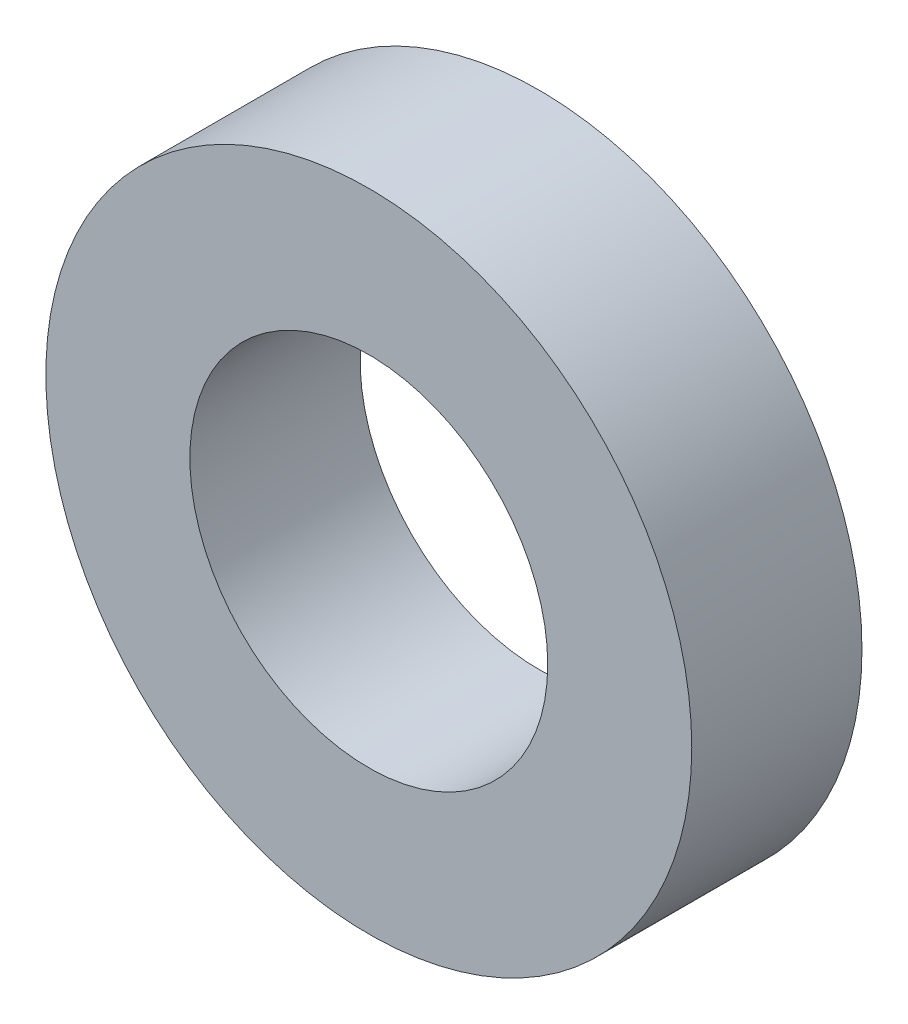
ISO-10303-21;
HEADER;
FILE_DESCRIPTION(('STEP AP214'),'2;1');
FILE_NAME('part.step','',(''),(''),'','','');
FILE_SCHEMA(('AUTOMOTIVE_DESIGN { 1 0 10303 214 1 1 1 1 }'));
ENDSEC;
DATA;
#1=APPLICATION_CONTEXT('core data for automotive mechanical design processes');
#2=APPLICATION_PROTOCOL_DEFINITION('international standard','automotive_design',2000,#1);
#3=PRODUCT_CONTEXT('',#1,'mechanical');
#4=PRODUCT('Part','Part','',(#3));
#5=PRODUCT_RELATED_PRODUCT_CATEGORY('part','',(#4));
#6=PRODUCT_DEFINITION_FORMATION('','',#4);
#7=PRODUCT_DEFINITION_CONTEXT('part definition',#1,'design');
#8=PRODUCT_DEFINITION('design','',#6,#7);
#9=PRODUCT_DEFINITION_SHAPE('','',#8);
#10=(LENGTH_UNIT() NAMED_UNIT(*) SI_UNIT(.MILLI.,.METRE.));
#11=(NAMED_UNIT(*) PLANE_ANGLE_UNIT() SI_UNIT($,.RADIAN.));
#12=(NAMED_UNIT(*) SI_UNIT($,.STERADIAN.) SOLID_ANGLE_UNIT());
#13=UNCERTAINTY_MEASURE_WITH_UNIT(LENGTH_MEASURE(1.E-05),#10,'distance_accuracy_value','');
#14=(GEOMETRIC_REPRESENTATION_CONTEXT(3) GLOBAL_UNCERTAINTY_ASSIGNED_CONTEXT((#13)) GLOBAL_UNIT_ASSIGNED_CONTEXT((#10,
#11,#12)) REPRESENTATION_CONTEXT('',''));
#15=CARTESIAN_POINT('',(0.,0.,0.));
#16=DIRECTION('',(0.,0.,1.));
#17=DIRECTION('',(1.,0.,0.));
#18=AXIS2_PLACEMENT_3D('',#15,#16,#17);
#19=CARTESIAN_POINT('',(0.,4.1,0.));
#20=DIRECTION('',(0.,0.,-1.));
#21=DIRECTION('',(-1.,0.,0.));
#22=AXIS2_PLACEMENT_3D('',#19,#20,#21);
#23=PLANE('',#22);
#24=CARTESIAN_POINT('',(0.,0.,0.));
#25=DIRECTION('',(0.,0.,1.));
#26=DIRECTION('',(1.,0.,0.));
#27=AXIS2_PLACEMENT_3D('',#24,#25,#26);
#28=CIRCLE('',#27,4.1);
#29=CARTESIAN_POINT('',(4.1,0.,0.));
#30=VERTEX_POINT('',#29);
#31=EDGE_CURVE('E43',#30,#30,#28,.T.);
#32=ORIENTED_EDGE('',*,*,#31,.F.);
#33=EDGE_LOOP('',(#32));
#34=FACE_BOUND('',#33,.T.);
#35=CARTESIAN_POINT('',(0.,0.,0.));
#36=DIRECTION('',(0.,0.,1.));
#37=DIRECTION('',(1.,0.,0.));
#38=AXIS2_PLACEMENT_3D('',#35,#36,#37);
#39=CIRCLE('',#38,7.4);
#40=CARTESIAN_POINT('',(7.4,0.,0.));
#41=VERTEX_POINT('',#40);
#42=EDGE_CURVE('E10',#41,#41,#39,.T.);
#43=ORIENTED_EDGE('',*,*,#42,.T.);
#44=EDGE_LOOP('',(#43));
#45=FACE_BOUND('',#44,.T.);
#46=ADVANCED_FACE('F29',(#34,#45),#23,.F.);
#47=CARTESIAN_POINT('',(0.,0.,0.));
#48=DIRECTION('',(0.,0.,1.));
#49=DIRECTION('',(1.,0.,0.));
#50=AXIS2_PLACEMENT_3D('',#47,#48,#49);
#51=CYLINDRICAL_SURFACE('',#50,7.4);
#52=ORIENTED_EDGE('',*,*,#42,.F.);
#53=EDGE_LOOP('',(#52));
#54=FACE_BOUND('',#53,.T.);
#55=CARTESIAN_POINT('',(0.,0.,-3.9));
#56=DIRECTION('',(0.,0.,1.));
#57=DIRECTION('',(1.,0.,0.));
#58=AXIS2_PLACEMENT_3D('',#55,#56,#57);
#59=CIRCLE('',#58,7.4);
#60=CARTESIAN_POINT('',(7.4,0.,-3.9));
#61=VERTEX_POINT('',#60);
#62=EDGE_CURVE('E35',#61,#61,#59,.T.);
#63=ORIENTED_EDGE('',*,*,#62,.T.);
#64=EDGE_LOOP('',(#63));
#65=FACE_BOUND('',#64,.T.);
#66=ADVANCED_FACE('F52',(#54,#65),#51,.T.);
#67=CARTESIAN_POINT('',(0.,4.1,-3.9));
#68=DIRECTION('',(0.,0.,1.));
#69=DIRECTION('',(1.,0.,0.));
#70=AXIS2_PLACEMENT_3D('',#67,#68,#69);
#71=PLANE('',#70);
#72=ORIENTED_EDGE('',*,*,#62,.F.);
#73=EDGE_LOOP('',(#72));
#74=FACE_BOUND('',#73,.T.);
#75=CARTESIAN_POINT('',(0.,0.,-3.9));
#76=DIRECTION('',(0.,0.,1.));
#77=DIRECTION('',(1.,0.,0.));
#78=AXIS2_PLACEMENT_3D('',#75,#76,#77);
#79=CIRCLE('',#78,4.1);
#80=CARTESIAN_POINT('',(4.1,0.,-3.9));
#81=VERTEX_POINT('',#80);
#82=EDGE_CURVE('E39',#81,#81,#79,.T.);
#83=ORIENTED_EDGE('',*,*,#82,.T.);
#84=EDGE_LOOP('',(#83));
#85=FACE_BOUND('',#84,.T.);
#86=ADVANCED_FACE('F56',(#74,#85),#71,.F.);
#87=CARTESIAN_POINT('',(0.,0.,0.));
#88=DIRECTION('',(0.,0.,1.));
#89=DIRECTION('',(1.,0.,0.));
#90=AXIS2_PLACEMENT_3D('',#87,#88,#89);
#91=CYLINDRICAL_SURFACE('',#90,4.1);
#92=ORIENTED_EDGE('',*,*,#82,.F.);
#93=EDGE_LOOP('',(#92));
#94=FACE_BOUND('',#93,.T.);
#95=ORIENTED_EDGE('',*,*,#31,.T.);
#96=EDGE_LOOP('',(#95));
#97=FACE_BOUND('',#96,.T.);
#98=ADVANCED_FACE('F49',(#94,#97),#91,.F.);
#99=CLOSED_SHELL('',(#46,#66,#86,#98));
#100=MANIFOLD_SOLID_BREP('B2',#99);
#101=ADVANCED_BREP_SHAPE_REPRESENTATION('',(#18,#100),#14);
#102=SHAPE_DEFINITION_REPRESENTATION(#9,#101);
ENDSEC;
END-ISO-10303-21;
